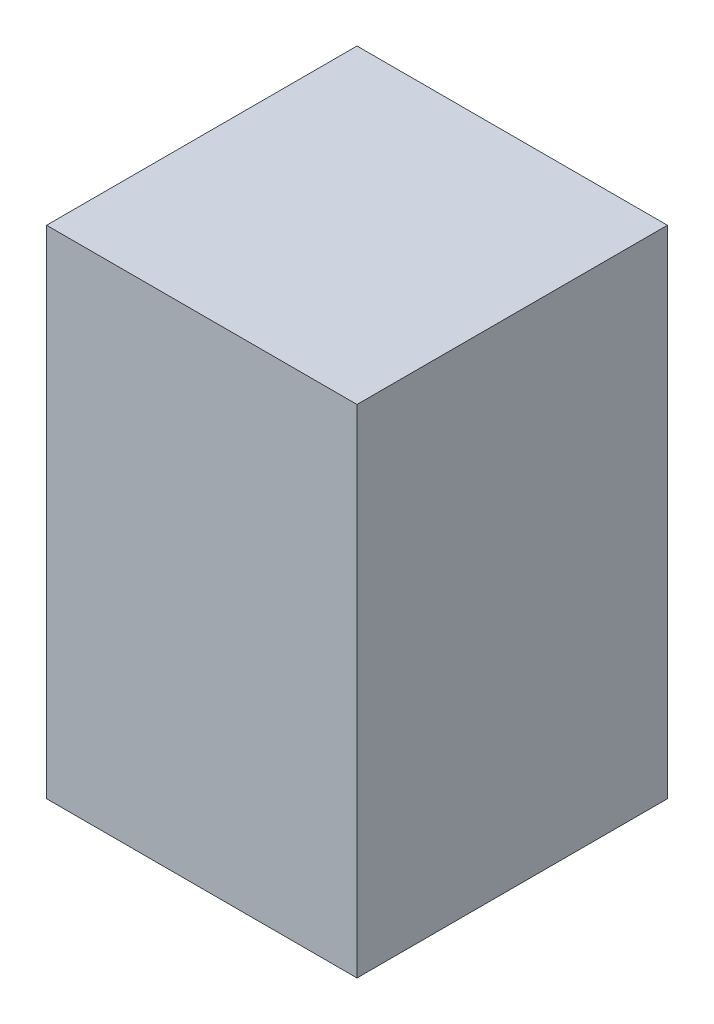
from build123d import *

# Parameters (mm, degrees)
SKETCH1_W           = 31.75
SKETCH1_H           = 31.75
BOSS_EXTRUDE1_DEPTH = 50.8
SKETCH2_R           = 4.7625
CUT_EXTRUDE1_DEPTH  = 38.1


with BuildPart() as part:
    # Sketch1 → Boss-Extrude1 (new body)
    with BuildSketch(Plane(origin=(0, 0, 0), x_dir=(1, 0, 0), z_dir=(0, 1, 0))):
        Rectangle(SKETCH1_W, SKETCH1_H)
    extrude(amount=BOSS_EXTRUDE1_DEPTH)

    # Sketch2 → Cut-Extrude1 (cut)
    with BuildSketch(Plane(origin=(0, 0, 0), x_dir=(-1, 0, 0), z_dir=(0, -1, 0))):
        with Locations(Location((0, 0, 0), (0, 0, 90))):
            Circle(SKETCH2_R)
    extrude(amount=-CUT_EXTRUDE1_DEPTH, mode=Mode.SUBTRACT)


solid = part.part
